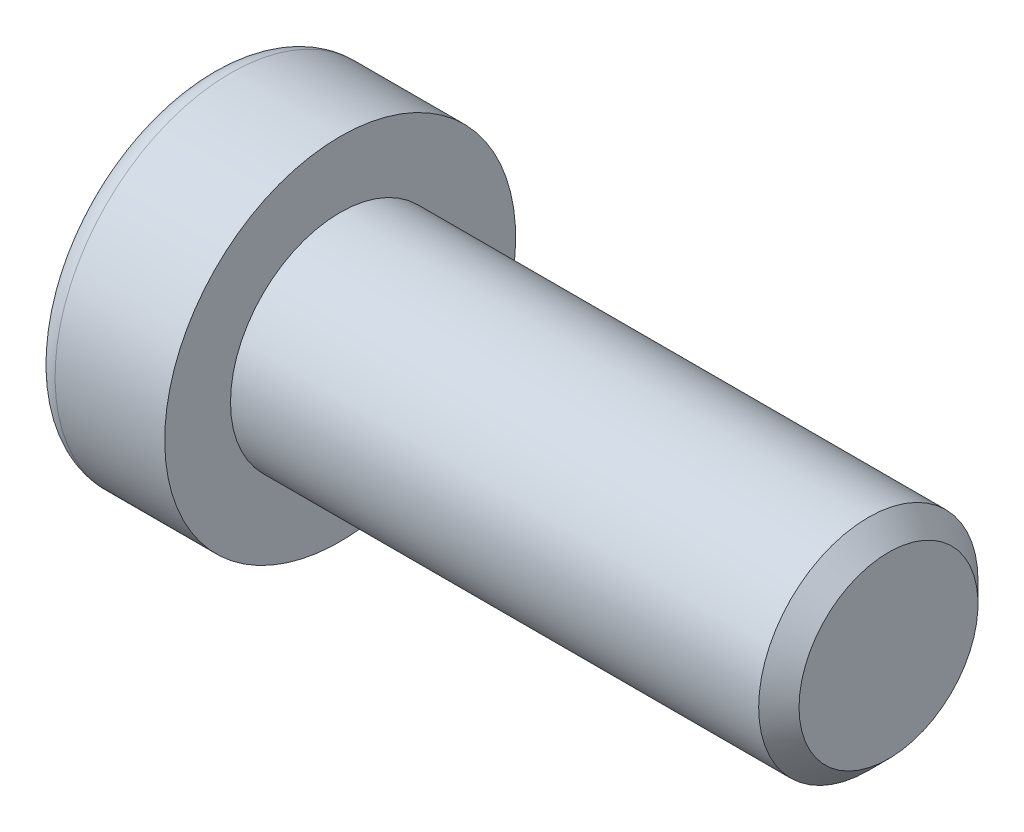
ISO-10303-21;
HEADER;
FILE_DESCRIPTION(('STEP AP214'),'2;1');
FILE_NAME('part.step','',(''),(''),'','','');
FILE_SCHEMA(('AUTOMOTIVE_DESIGN { 1 0 10303 214 1 1 1 1 }'));
ENDSEC;
DATA;
#1=APPLICATION_CONTEXT('core data for automotive mechanical design processes');
#2=APPLICATION_PROTOCOL_DEFINITION('international standard','automotive_design',2000,#1);
#3=PRODUCT_CONTEXT('',#1,'mechanical');
#4=PRODUCT('Part','Part','',(#3));
#5=PRODUCT_RELATED_PRODUCT_CATEGORY('part','',(#4));
#6=PRODUCT_DEFINITION_FORMATION('','',#4);
#7=PRODUCT_DEFINITION_CONTEXT('part definition',#1,'design');
#8=PRODUCT_DEFINITION('design','',#6,#7);
#9=PRODUCT_DEFINITION_SHAPE('','',#8);
#10=(LENGTH_UNIT() NAMED_UNIT(*) SI_UNIT(.MILLI.,.METRE.));
#11=(NAMED_UNIT(*) PLANE_ANGLE_UNIT() SI_UNIT($,.RADIAN.));
#12=(NAMED_UNIT(*) SI_UNIT($,.STERADIAN.) SOLID_ANGLE_UNIT());
#13=UNCERTAINTY_MEASURE_WITH_UNIT(LENGTH_MEASURE(1.E-05),#10,'distance_accuracy_value','');
#14=(GEOMETRIC_REPRESENTATION_CONTEXT(3) GLOBAL_UNCERTAINTY_ASSIGNED_CONTEXT((#13)) GLOBAL_UNIT_ASSIGNED_CONTEXT((#10,
#11,#12)) REPRESENTATION_CONTEXT('',''));
#15=CARTESIAN_POINT('',(0.,0.,0.));
#16=DIRECTION('',(0.,0.,1.));
#17=DIRECTION('',(1.,0.,0.));
#18=AXIS2_PLACEMENT_3D('',#15,#16,#17);
#19=CARTESIAN_POINT('',(-1.51400000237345,0.,0.));
#20=DIRECTION('',(-1.,0.,0.));
#21=DIRECTION('',(0.,0.,1.));
#22=AXIS2_PLACEMENT_3D('',#19,#20,#21);
#23=CONICAL_SURFACE('',#22,4.06570059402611,1.04719754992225);
#24=CARTESIAN_POINT('',(0.833333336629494,-1.70530256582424E-10,0.));
#25=VERTEX_POINT('',#24);
#26=VERTEX_LOOP('',#25);
#27=FACE_BOUND('',#26,.T.);
#28=CARTESIAN_POINT('',(-1.50000000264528,3.50000000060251,2.02072594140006));
#29=CARTESIAN_POINT('',(-1.44871720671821,3.5000000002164,1.84312860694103));
#30=CARTESIAN_POINT('',(-1.40207818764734,3.500000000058,1.66399825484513));
#31=CARTESIAN_POINT('',(-1.3206711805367,3.49999999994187,1.30263602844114));
#32=CARTESIAN_POINT('',(-1.28593198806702,3.49999999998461,1.12039773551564));
#33=CARTESIAN_POINT('',(-1.23185793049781,3.50000000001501,0.758179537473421));
#34=CARTESIAN_POINT('',(-1.21216313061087,3.500000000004,0.578255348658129));
#35=CARTESIAN_POINT('',(-1.18865604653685,3.49999999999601,0.217560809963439));
#36=CARTESIAN_POINT('',(-1.18482429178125,3.499999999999,0.0367917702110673));
#37=CARTESIAN_POINT('',(-1.19281601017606,3.50000000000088,-0.300955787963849));
#38=CARTESIAN_POINT('',(-1.20267725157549,3.50000000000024,-0.457984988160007));
#39=CARTESIAN_POINT('',(-1.23392527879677,3.49999999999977,-0.771020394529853));
#40=CARTESIAN_POINT('',(-1.25532272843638,3.49999999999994,-0.927025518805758));
#41=CARTESIAN_POINT('',(-1.30881221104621,3.50000000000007,-1.24070580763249));
#42=CARTESIAN_POINT('',(-1.34113087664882,3.50000000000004,-1.39834129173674));
#43=CARTESIAN_POINT('',(-1.41448058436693,3.49999999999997,-1.71126180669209));
#44=CARTESIAN_POINT('',(-1.45549440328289,3.49999999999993,-1.86655084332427));
#45=CARTESIAN_POINT('',(-1.50000000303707,3.5,-2.02072594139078));
#46=B_SPLINE_CURVE_WITH_KNOTS('',3,(#28,#29,#30,#31,#32,#33,#34,#35,#36,#37,#38,#39,#40,#41,#42,
#43,#44,#45),.UNSPECIFIED.,.F.,.F.,(4,2,2,2,2,2,2,2,4),(0.,0.554778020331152,1.11088918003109,
1.65323831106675,2.19492155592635,2.66648861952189,3.13849233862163,3.62096283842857,
4.10248645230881),.UNSPECIFIED.);
#47=CARTESIAN_POINT('',(-1.5000000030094,3.49999999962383,2.0207259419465));
#48=VERTEX_POINT('',#47);
#49=CARTESIAN_POINT('',(-1.50000000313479,3.5,-2.02072594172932));
#50=VERTEX_POINT('',#49);
#51=EDGE_CURVE('E20',#48,#50,#46,.T.);
#52=ORIENTED_EDGE('',*,*,#51,.T.);
#53=CARTESIAN_POINT('',(-1.50000000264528,3.49999999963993,-2.0207259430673));
#54=CARTESIAN_POINT('',(-1.44871720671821,3.34619619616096,-2.10952460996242));
#55=CARTESIAN_POINT('',(-1.40207818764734,3.19106476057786,-2.1990897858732));
#56=CARTESIAN_POINT('',(-1.3206711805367,2.87811589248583,-2.37977089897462));
#57=CARTESIAN_POINT('',(-1.28593198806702,2.72029290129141,-2.47089004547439));
#58=CARTESIAN_POINT('',(-1.2318579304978,2.40660274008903,-2.65199914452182));
#59=CARTESIAN_POINT('',(-1.21216313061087,2.25078382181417,-2.74196123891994));
#60=CARTESIAN_POINT('',(-1.18865604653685,1.93841318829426,-2.92230850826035));
#61=CARTESIAN_POINT('',(-1.18482429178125,1.78186260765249,-3.01269302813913));
#62=CARTESIAN_POINT('',(-1.19281601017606,1.48936464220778,-3.18156680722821));
#63=CARTESIAN_POINT('',(-1.20267725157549,1.35337336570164,-3.26008140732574));
#64=CARTESIAN_POINT('',(-1.23392527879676,1.08227675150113,-3.41659911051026));
#65=CARTESIAN_POINT('',(-1.25532272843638,0.947172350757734,-3.49460167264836));
#66=CARTESIAN_POINT('',(-1.30881221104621,0.675517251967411,-3.65144181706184));
#67=CARTESIAN_POINT('',(-1.34113087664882,0.539000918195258,-3.73025955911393));
#68=CARTESIAN_POINT('',(-1.41448058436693,0.26800380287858,-3.88671981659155));
#69=CARTESIAN_POINT('',(-1.45549440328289,0.133519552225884,-3.96436433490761));
#70=CARTESIAN_POINT('',(-1.50000000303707,6.69361529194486E-10,-4.04145188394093));
#71=B_SPLINE_CURVE_WITH_KNOTS('',3,(#53,#54,#55,#56,#57,#58,#59,#60,#61,#62,#63,#64,#65,#66,#67,
#68,#69,#70),.UNSPECIFIED.,.F.,.F.,(4,2,2,2,2,2,2,2,4),(0.,0.554778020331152,1.11088918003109,
1.65323831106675,2.19492155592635,2.66648861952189,3.13849233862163,3.62096283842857,
4.10248645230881),.UNSPECIFIED.);
#72=CARTESIAN_POINT('',(-1.5000000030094,0.,-4.04145188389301));
#73=VERTEX_POINT('',#72);
#74=EDGE_CURVE('E91',#50,#73,#71,.T.);
#75=ORIENTED_EDGE('',*,*,#74,.T.);
#76=CARTESIAN_POINT('',(-1.50000000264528,-9.62577057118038E-10,-4.04145188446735));
#77=CARTESIAN_POINT('',(-1.44871720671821,-0.153803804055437,-3.95265321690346));
#78=CARTESIAN_POINT('',(-1.40207818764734,-0.308935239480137,-3.86308804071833));
#79=CARTESIAN_POINT('',(-1.3206711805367,-0.621884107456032,-3.68240692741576));
#80=CARTESIAN_POINT('',(-1.28593198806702,-0.779707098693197,-3.59128778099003));
#81=CARTESIAN_POINT('',(-1.2318579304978,-1.09339725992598,-3.41017868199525));
#82=CARTESIAN_POINT('',(-1.21216313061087,-1.24921617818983,-3.32021658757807));
#83=CARTESIAN_POINT('',(-1.18865604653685,-1.56158681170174,-3.1398693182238));
#84=CARTESIAN_POINT('',(-1.18482429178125,-1.71813739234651,-3.0494847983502));
#85=CARTESIAN_POINT('',(-1.19281601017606,-2.01063535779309,-2.88061101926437));
#86=CARTESIAN_POINT('',(-1.20267725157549,-2.1466266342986,-2.80209641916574));
#87=CARTESIAN_POINT('',(-1.23392527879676,-2.41772324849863,-2.64557871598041));
#88=CARTESIAN_POINT('',(-1.25532272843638,-2.5528276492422,-2.5675761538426));
#89=CARTESIAN_POINT('',(-1.30881221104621,-2.82448274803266,-2.41073600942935));
#90=CARTESIAN_POINT('',(-1.34113087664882,-2.96099908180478,-2.3319182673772));
#91=CARTESIAN_POINT('',(-1.41448058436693,-3.23199619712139,-2.17545800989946));
#92=CARTESIAN_POINT('',(-1.45549440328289,-3.36648044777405,-2.09781349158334));
#93=CARTESIAN_POINT('',(-1.50000000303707,-3.49999999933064,-2.02072594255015));
#94=B_SPLINE_CURVE_WITH_KNOTS('',3,(#76,#77,#78,#79,#80,#81,#82,#83,#84,#85,#86,#87,#88,#89,#90,
#91,#92,#93),.UNSPECIFIED.,.F.,.F.,(4,2,2,2,2,2,2,2,4),(0.,0.554778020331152,1.11088918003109,
1.65323831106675,2.19492155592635,2.66648861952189,3.13849233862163,3.62096283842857,
4.10248645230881),.UNSPECIFIED.);
#95=CARTESIAN_POINT('',(-1.5000000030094,-3.49999999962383,-2.0207259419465));
#96=VERTEX_POINT('',#95);
#97=EDGE_CURVE('E122',#73,#96,#94,.T.);
#98=ORIENTED_EDGE('',*,*,#97,.T.);
#99=CARTESIAN_POINT('',(-1.50000000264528,-3.50000000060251,-2.02072594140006));
#100=CARTESIAN_POINT('',(-1.44871720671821,-3.50000000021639,-1.84312860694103));
#101=CARTESIAN_POINT('',(-1.40207818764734,-3.500000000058,-1.66399825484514));
#102=CARTESIAN_POINT('',(-1.3206711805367,-3.49999999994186,-1.30263602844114));
#103=CARTESIAN_POINT('',(-1.28593198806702,-3.49999999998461,-1.12039773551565));
#104=CARTESIAN_POINT('',(-1.2318579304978,-3.50000000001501,-0.758179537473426));
#105=CARTESIAN_POINT('',(-1.21216313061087,-3.500000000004,-0.578255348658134));
#106=CARTESIAN_POINT('',(-1.18865604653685,-3.499999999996,-0.217560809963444));
#107=CARTESIAN_POINT('',(-1.18482429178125,-3.499999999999,-0.0367917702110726));
#108=CARTESIAN_POINT('',(-1.19281601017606,-3.50000000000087,0.300955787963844));
#109=CARTESIAN_POINT('',(-1.20267725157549,-3.50000000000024,0.457984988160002));
#110=CARTESIAN_POINT('',(-1.23392527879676,-3.49999999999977,0.771020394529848));
#111=CARTESIAN_POINT('',(-1.25532272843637,-3.49999999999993,0.927025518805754));
#112=CARTESIAN_POINT('',(-1.30881221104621,-3.50000000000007,1.24070580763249));
#113=CARTESIAN_POINT('',(-1.34113087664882,-3.50000000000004,1.39834129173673));
#114=CARTESIAN_POINT('',(-1.41448058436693,-3.49999999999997,1.71126180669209));
#115=CARTESIAN_POINT('',(-1.45549440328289,-3.49999999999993,1.86655084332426));
#116=CARTESIAN_POINT('',(-1.50000000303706,-3.5,2.02072594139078));
#117=B_SPLINE_CURVE_WITH_KNOTS('',3,(#99,#100,#101,#102,#103,#104,#105,#106,#107,#108,#109,#110,
#111,#112,#113,#114,#115,#116),.UNSPECIFIED.,.F.,.F.,(4,2,2,2,2,2,2,2,4),(0.,0.554778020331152,
1.11088918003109,1.65323831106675,2.19492155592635,2.66648861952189,3.13849233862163,
3.62096283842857,4.10248645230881),.UNSPECIFIED.);
#118=CARTESIAN_POINT('',(-1.5000000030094,-3.49999999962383,2.0207259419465));
#119=VERTEX_POINT('',#118);
#120=EDGE_CURVE('E146',#96,#119,#117,.T.);
#121=ORIENTED_EDGE('',*,*,#120,.T.);
#122=CARTESIAN_POINT('',(-1.50000000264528,-3.49999999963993,2.02072594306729));
#123=CARTESIAN_POINT('',(-1.44871720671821,-3.34619619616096,2.10952460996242));
#124=CARTESIAN_POINT('',(-1.40207818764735,-3.19106476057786,2.19908978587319));
#125=CARTESIAN_POINT('',(-1.3206711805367,-2.87811589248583,2.37977089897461));
#126=CARTESIAN_POINT('',(-1.28593198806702,-2.72029290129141,2.47089004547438));
#127=CARTESIAN_POINT('',(-1.2318579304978,-2.40660274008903,2.65199914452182));
#128=CARTESIAN_POINT('',(-1.21216313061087,-2.25078382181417,2.74196123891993));
#129=CARTESIAN_POINT('',(-1.18865604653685,-1.93841318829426,2.92230850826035));
#130=CARTESIAN_POINT('',(-1.18482429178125,-1.78186260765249,3.01269302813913));
#131=CARTESIAN_POINT('',(-1.19281601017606,-1.48936464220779,3.18156680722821));
#132=CARTESIAN_POINT('',(-1.20267725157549,-1.35337336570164,3.26008140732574));
#133=CARTESIAN_POINT('',(-1.23392527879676,-1.08227675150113,3.41659911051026));
#134=CARTESIAN_POINT('',(-1.25532272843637,-0.947172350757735,3.49460167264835));
#135=CARTESIAN_POINT('',(-1.30881221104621,-0.675517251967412,3.65144181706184));
#136=CARTESIAN_POINT('',(-1.34113087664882,-0.539000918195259,3.73025955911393));
#137=CARTESIAN_POINT('',(-1.41448058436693,-0.268003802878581,3.88671981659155));
#138=CARTESIAN_POINT('',(-1.45549440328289,-0.133519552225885,3.96436433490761));
#139=CARTESIAN_POINT('',(-1.50000000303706,-6.693623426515E-10,4.04145188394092));
#140=B_SPLINE_CURVE_WITH_KNOTS('',3,(#122,#123,#124,#125,#126,#127,#128,#129,#130,#131,#132,
#133,#134,#135,#136,#137,#138,#139),.UNSPECIFIED.,.F.,.F.,(4,2,2,2,2,2,2,2,4),(0.,
0.554778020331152,1.11088918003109,1.65323831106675,2.19492155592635,2.66648861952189,
3.13849233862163,3.62096283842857,4.10248645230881),.UNSPECIFIED.);
#141=CARTESIAN_POINT('',(-1.5000000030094,0.,4.04145188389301));
#142=VERTEX_POINT('',#141);
#143=EDGE_CURVE('E155',#119,#142,#140,.T.);
#144=ORIENTED_EDGE('',*,*,#143,.T.);
#145=CARTESIAN_POINT('',(-1.50000000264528,9.6257699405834E-10,4.04145188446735));
#146=CARTESIAN_POINT('',(-1.44871720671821,0.153803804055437,3.95265321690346));
#147=CARTESIAN_POINT('',(-1.40207818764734,0.308935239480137,3.86308804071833));
#148=CARTESIAN_POINT('',(-1.3206711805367,0.621884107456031,3.68240692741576));
#149=CARTESIAN_POINT('',(-1.28593198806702,0.779707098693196,3.59128778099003));
#150=CARTESIAN_POINT('',(-1.2318579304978,1.09339725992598,3.41017868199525));
#151=CARTESIAN_POINT('',(-1.21216313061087,1.24921617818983,3.32021658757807));
#152=CARTESIAN_POINT('',(-1.18865604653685,1.56158681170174,3.1398693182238));
#153=CARTESIAN_POINT('',(-1.18482429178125,1.71813739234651,3.0494847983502));
#154=CARTESIAN_POINT('',(-1.19281601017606,2.01063535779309,2.88061101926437));
#155=CARTESIAN_POINT('',(-1.20267725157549,2.14662663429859,2.80209641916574));
#156=CARTESIAN_POINT('',(-1.23392527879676,2.41772324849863,2.6455787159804));
#157=CARTESIAN_POINT('',(-1.25532272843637,2.5528276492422,2.5675761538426));
#158=CARTESIAN_POINT('',(-1.30881221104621,2.82448274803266,2.41073600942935));
#159=CARTESIAN_POINT('',(-1.34113087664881,2.96099908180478,2.33191826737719));
#160=CARTESIAN_POINT('',(-1.41448058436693,3.23199619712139,2.17545800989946));
#161=CARTESIAN_POINT('',(-1.45549440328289,3.36648044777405,2.09781349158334));
#162=CARTESIAN_POINT('',(-1.50000000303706,3.49999999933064,2.02072594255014));
#163=B_SPLINE_CURVE_WITH_KNOTS('',3,(#145,#146,#147,#148,#149,#150,#151,#152,#153,#154,#155,
#156,#157,#158,#159,#160,#161,#162),.UNSPECIFIED.,.F.,.F.,(4,2,2,2,2,2,2,2,4),(0.,
0.554778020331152,1.11088918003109,1.65323831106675,2.19492155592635,2.66648861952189,
3.13849233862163,3.62096283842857,4.10248645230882),.UNSPECIFIED.);
#164=EDGE_CURVE('E93',#142,#48,#163,.T.);
#165=ORIENTED_EDGE('',*,*,#164,.T.);
#166=EDGE_LOOP('',(#52,#75,#98,#121,#144,#165));
#167=FACE_BOUND('',#166,.T.);
#168=ADVANCED_FACE('F16',(#27,#167),#23,.F.);
#169=CARTESIAN_POINT('',(-6.,3.5,2.02072594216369));
#170=DIRECTION('',(0.,1.,0.));
#171=DIRECTION('',(0.,0.,1.));
#172=AXIS2_PLACEMENT_3D('',#169,#170,#171);
#173=PLANE('',#172);
#174=DIRECTION('',(1.,0.,0.));
#175=VECTOR('',#174,1.);
#176=CARTESIAN_POINT('',(-6.,3.5,2.02072594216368));
#177=LINE('',#176,#175);
#178=CARTESIAN_POINT('',(-6.,3.5,2.02072594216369));
#179=VERTEX_POINT('',#178);
#180=EDGE_CURVE('E97',#48,#179,#177,.F.);
#181=ORIENTED_EDGE('',*,*,#180,.T.);
#182=DIRECTION('',(0.,0.,1.));
#183=VECTOR('',#182,1.);
#184=CARTESIAN_POINT('',(-6.,3.5,0.));
#185=LINE('',#184,#183);
#186=CARTESIAN_POINT('',(-6.,3.5,-2.02072594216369));
#187=VERTEX_POINT('',#186);
#188=EDGE_CURVE('E102',#187,#179,#185,.T.);
#189=ORIENTED_EDGE('',*,*,#188,.F.);
#190=DIRECTION('',(1.,0.,0.));
#191=VECTOR('',#190,1.);
#192=CARTESIAN_POINT('',(-6.,3.5,-2.02072594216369));
#193=LINE('',#192,#191);
#194=EDGE_CURVE('E100',#187,#50,#193,.T.);
#195=ORIENTED_EDGE('',*,*,#194,.T.);
#196=ORIENTED_EDGE('',*,*,#51,.F.);
#197=EDGE_LOOP('',(#181,#189,#195,#196));
#198=FACE_BOUND('',#197,.T.);
#199=ADVANCED_FACE('F87',(#198),#173,.F.);
#200=CARTESIAN_POINT('',(-6.,0.,4.04145188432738));
#201=DIRECTION('',(0.,0.500000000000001,0.866025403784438));
#202=DIRECTION('',(0.,-0.866025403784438,0.500000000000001));
#203=AXIS2_PLACEMENT_3D('',#200,#201,#202);
#204=PLANE('',#203);
#205=DIRECTION('',(1.,0.,0.));
#206=VECTOR('',#205,1.);
#207=CARTESIAN_POINT('',(-6.,0.,4.04145188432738));
#208=LINE('',#207,#206);
#209=CARTESIAN_POINT('',(-6.,0.,4.04145188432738));
#210=VERTEX_POINT('',#209);
#211=EDGE_CURVE('E160',#142,#210,#208,.F.);
#212=ORIENTED_EDGE('',*,*,#211,.T.);
#213=DIRECTION('',(0.,-0.866025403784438,0.500000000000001));
#214=VECTOR('',#213,1.);
#215=CARTESIAN_POINT('',(-6.,3.5,2.02072594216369));
#216=LINE('',#215,#214);
#217=EDGE_CURVE('E112',#179,#210,#216,.T.);
#218=ORIENTED_EDGE('',*,*,#217,.F.);
#219=ORIENTED_EDGE('',*,*,#180,.F.);
#220=ORIENTED_EDGE('',*,*,#164,.F.);
#221=EDGE_LOOP('',(#212,#218,#219,#220));
#222=FACE_BOUND('',#221,.T.);
#223=ADVANCED_FACE('F165',(#222),#204,.F.);
#224=CARTESIAN_POINT('',(-6.,-3.5,2.02072594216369));
#225=DIRECTION('',(0.,-0.5,0.866025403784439));
#226=DIRECTION('',(0.,-0.866025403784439,-0.5));
#227=AXIS2_PLACEMENT_3D('',#224,#225,#226);
#228=PLANE('',#227);
#229=DIRECTION('',(1.,0.,0.));
#230=VECTOR('',#229,1.);
#231=CARTESIAN_POINT('',(-6.,-3.5,2.02072594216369));
#232=LINE('',#231,#230);
#233=CARTESIAN_POINT('',(-6.,-3.5,2.02072594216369));
#234=VERTEX_POINT('',#233);
#235=EDGE_CURVE('E154',#119,#234,#232,.F.);
#236=ORIENTED_EDGE('',*,*,#235,.T.);
#237=DIRECTION('',(0.,-0.866025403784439,-0.5));
#238=VECTOR('',#237,1.);
#239=CARTESIAN_POINT('',(-6.,0.,4.04145188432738));
#240=LINE('',#239,#238);
#241=EDGE_CURVE('E251',#210,#234,#240,.T.);
#242=ORIENTED_EDGE('',*,*,#241,.F.);
#243=ORIENTED_EDGE('',*,*,#211,.F.);
#244=ORIENTED_EDGE('',*,*,#143,.F.);
#245=EDGE_LOOP('',(#236,#242,#243,#244));
#246=FACE_BOUND('',#245,.T.);
#247=ADVANCED_FACE('F142',(#246),#228,.F.);
#248=CARTESIAN_POINT('',(-6.,-3.5,-2.02072594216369));
#249=DIRECTION('',(0.,-1.,0.));
#250=DIRECTION('',(0.,0.,-1.));
#251=AXIS2_PLACEMENT_3D('',#248,#249,#250);
#252=PLANE('',#251);
#253=DIRECTION('',(1.,0.,0.));
#254=VECTOR('',#253,1.);
#255=CARTESIAN_POINT('',(-6.,-3.5,-2.02072594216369));
#256=LINE('',#255,#254);
#257=CARTESIAN_POINT('',(-6.,-3.5,-2.02072594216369));
#258=VERTEX_POINT('',#257);
#259=EDGE_CURVE('E153',#96,#258,#256,.F.);
#260=ORIENTED_EDGE('',*,*,#259,.T.);
#261=DIRECTION('',(0.,0.,1.));
#262=VECTOR('',#261,1.);
#263=CARTESIAN_POINT('',(-6.,-3.5,0.));
#264=LINE('',#263,#262);
#265=EDGE_CURVE('E247',#234,#258,#264,.F.);
#266=ORIENTED_EDGE('',*,*,#265,.F.);
#267=ORIENTED_EDGE('',*,*,#235,.F.);
#268=ORIENTED_EDGE('',*,*,#120,.F.);
#269=EDGE_LOOP('',(#260,#266,#267,#268));
#270=FACE_BOUND('',#269,.T.);
#271=ADVANCED_FACE('F138',(#270),#252,.F.);
#272=CARTESIAN_POINT('',(-6.,0.,-4.04145188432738));
#273=DIRECTION('',(0.,-0.5,-0.866025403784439));
#274=DIRECTION('',(0.,0.866025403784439,-0.5));
#275=AXIS2_PLACEMENT_3D('',#272,#273,#274);
#276=PLANE('',#275);
#277=DIRECTION('',(1.,0.,0.));
#278=VECTOR('',#277,1.);
#279=CARTESIAN_POINT('',(-6.,0.,-4.04145188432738));
#280=LINE('',#279,#278);
#281=CARTESIAN_POINT('',(-6.,0.,-4.04145188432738));
#282=VERTEX_POINT('',#281);
#283=EDGE_CURVE('E41',#73,#282,#280,.F.);
#284=ORIENTED_EDGE('',*,*,#283,.T.);
#285=DIRECTION('',(0.,0.866025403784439,-0.5));
#286=VECTOR('',#285,1.);
#287=CARTESIAN_POINT('',(-6.,-3.5,-2.02072594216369));
#288=LINE('',#287,#286);
#289=EDGE_CURVE('E243',#258,#282,#288,.T.);
#290=ORIENTED_EDGE('',*,*,#289,.F.);
#291=ORIENTED_EDGE('',*,*,#259,.F.);
#292=ORIENTED_EDGE('',*,*,#97,.F.);
#293=EDGE_LOOP('',(#284,#290,#291,#292));
#294=FACE_BOUND('',#293,.T.);
#295=ADVANCED_FACE('F132',(#294),#276,.F.);
#296=CARTESIAN_POINT('',(-6.,3.5,-2.02072594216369));
#297=DIRECTION('',(0.,0.5,-0.866025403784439));
#298=DIRECTION('',(0.,0.866025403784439,0.5));
#299=AXIS2_PLACEMENT_3D('',#296,#297,#298);
#300=PLANE('',#299);
#301=ORIENTED_EDGE('',*,*,#194,.F.);
#302=DIRECTION('',(0.,0.866025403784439,0.5));
#303=VECTOR('',#302,1.);
#304=CARTESIAN_POINT('',(-6.,0.,-4.04145188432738));
#305=LINE('',#304,#303);
#306=EDGE_CURVE('E240',#282,#187,#305,.T.);
#307=ORIENTED_EDGE('',*,*,#306,.F.);
#308=ORIENTED_EDGE('',*,*,#283,.F.);
#309=ORIENTED_EDGE('',*,*,#74,.F.);
#310=EDGE_LOOP('',(#301,#307,#308,#309));
#311=FACE_BOUND('',#310,.T.);
#312=ADVANCED_FACE('F107',(#311),#300,.F.);
#313=CARTESIAN_POINT('',(-6.,6.02072594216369,0.));
#314=DIRECTION('',(-1.,0.,0.));
#315=DIRECTION('',(0.,0.,1.));
#316=AXIS2_PLACEMENT_3D('',#313,#314,#315);
#317=PLANE('',#316);
#318=ORIENTED_EDGE('',*,*,#289,.T.);
#319=ORIENTED_EDGE('',*,*,#306,.T.);
#320=ORIENTED_EDGE('',*,*,#188,.T.);
#321=ORIENTED_EDGE('',*,*,#217,.T.);
#322=ORIENTED_EDGE('',*,*,#241,.T.);
#323=ORIENTED_EDGE('',*,*,#265,.T.);
#324=EDGE_LOOP('',(#318,#319,#320,#321,#322,#323));
#325=FACE_BOUND('',#324,.T.);
#326=CARTESIAN_POINT('',(-6.,0.,0.));
#327=DIRECTION('',(1.,0.,0.));
#328=DIRECTION('',(0.,1.,0.));
#329=AXIS2_PLACEMENT_3D('',#326,#327,#328);
#330=CIRCLE('',#329,7.);
#331=CARTESIAN_POINT('',(-6.,7.,0.));
#332=VERTEX_POINT('',#331);
#333=EDGE_CURVE('E212',#332,#332,#330,.T.);
#334=ORIENTED_EDGE('',*,*,#333,.F.);
#335=EDGE_LOOP('',(#334));
#336=FACE_BOUND('',#335,.T.);
#337=ADVANCED_FACE('F131',(#325,#336),#317,.T.);
#338=CARTESIAN_POINT('',(-5.,0.,0.));
#339=DIRECTION('',(1.,0.,0.));
#340=DIRECTION('',(0.,0.,-1.));
#341=AXIS2_PLACEMENT_3D('',#338,#339,#340);
#342=TOROIDAL_SURFACE('',#341,7.,1.);
#343=CARTESIAN_POINT('',(-5.,0.,0.));
#344=DIRECTION('',(1.,0.,0.));
#345=DIRECTION('',(0.,1.,0.));
#346=AXIS2_PLACEMENT_3D('',#343,#344,#345);
#347=CIRCLE('',#346,8.);
#348=CARTESIAN_POINT('',(-5.,8.,0.));
#349=VERTEX_POINT('',#348);
#350=EDGE_CURVE('E265',#349,#349,#347,.T.);
#351=ORIENTED_EDGE('',*,*,#350,.F.);
#352=EDGE_LOOP('',(#351));
#353=FACE_BOUND('',#352,.T.);
#354=ORIENTED_EDGE('',*,*,#333,.T.);
#355=EDGE_LOOP('',(#354));
#356=FACE_BOUND('',#355,.T.);
#357=ADVANCED_FACE('F196',(#353,#356),#342,.T.);
#358=CARTESIAN_POINT('',(-3.,0.,0.));
#359=DIRECTION('',(1.,0.,0.));
#360=DIRECTION('',(0.,1.,0.));
#361=AXIS2_PLACEMENT_3D('',#358,#359,#360);
#362=CYLINDRICAL_SURFACE('',#361,8.);
#363=ORIENTED_EDGE('',*,*,#350,.T.);
#364=EDGE_LOOP('',(#363));
#365=FACE_BOUND('',#364,.T.);
#366=CARTESIAN_POINT('',(0.,0.,0.));
#367=DIRECTION('',(1.,0.,0.));
#368=DIRECTION('',(0.,1.,0.));
#369=AXIS2_PLACEMENT_3D('',#366,#367,#368);
#370=CIRCLE('',#369,8.);
#371=CARTESIAN_POINT('',(0.,8.,0.));
#372=VERTEX_POINT('',#371);
#373=EDGE_CURVE('E120',#372,#372,#370,.T.);
#374=ORIENTED_EDGE('',*,*,#373,.F.);
#375=EDGE_LOOP('',(#374));
#376=FACE_BOUND('',#375,.T.);
#377=ADVANCED_FACE('F193',(#365,#376),#362,.T.);
#378=CARTESIAN_POINT('',(25.,2.5,0.));
#379=DIRECTION('',(1.,0.,0.));
#380=DIRECTION('',(0.,0.,-1.));
#381=AXIS2_PLACEMENT_3D('',#378,#379,#380);
#382=PLANE('',#381);
#383=CARTESIAN_POINT('',(25.000000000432,0.,0.));
#384=DIRECTION('',(-1.,0.,0.));
#385=DIRECTION('',(0.,0.,1.));
#386=AXIS2_PLACEMENT_3D('',#383,#384,#385);
#387=CIRCLE('',#386,4.07982500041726);
#388=CARTESIAN_POINT('',(25.000000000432,0.,4.07982500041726));
#389=VERTEX_POINT('',#388);
#390=EDGE_CURVE('E260',#389,#389,#387,.T.);
#391=ORIENTED_EDGE('',*,*,#390,.F.);
#392=EDGE_LOOP('',(#391));
#393=FACE_BOUND('',#392,.T.);
#394=ADVANCED_FACE('F189',(#393),#382,.T.);
#395=CARTESIAN_POINT('',(0.,6.5,0.));
#396=DIRECTION('',(1.,0.,0.));
#397=DIRECTION('',(0.,0.,-1.));
#398=AXIS2_PLACEMENT_3D('',#395,#396,#397);
#399=PLANE('',#398);
#400=CARTESIAN_POINT('',(0.,0.,0.));
#401=DIRECTION('',(1.,0.,0.));
#402=DIRECTION('',(0.,1.,0.));
#403=AXIS2_PLACEMENT_3D('',#400,#401,#402);
#404=CIRCLE('',#403,5.);
#405=CARTESIAN_POINT('',(0.,5.,0.));
#406=VERTEX_POINT('',#405);
#407=EDGE_CURVE('E29',#406,#406,#404,.T.);
#408=ORIENTED_EDGE('',*,*,#407,.F.);
#409=EDGE_LOOP('',(#408));
#410=FACE_BOUND('',#409,.T.);
#411=ORIENTED_EDGE('',*,*,#373,.T.);
#412=EDGE_LOOP('',(#411));
#413=FACE_BOUND('',#412,.T.);
#414=ADVANCED_FACE('F182',(#410,#413),#399,.T.);
#415=CARTESIAN_POINT('',(24.0798249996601,0.,0.));
#416=DIRECTION('',(-1.,0.,0.));
#417=DIRECTION('',(0.,0.,1.));
#418=AXIS2_PLACEMENT_3D('',#415,#416,#417);
#419=CONICAL_SURFACE('',#418,4.99999999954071,0.785398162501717);
#420=ORIENTED_EDGE('',*,*,#390,.T.);
#421=EDGE_LOOP('',(#420));
#422=FACE_BOUND('',#421,.T.);
#423=CARTESIAN_POINT('',(24.079825,0.,0.));
#424=DIRECTION('',(1.,0.,0.));
#425=DIRECTION('',(0.,1.,0.));
#426=AXIS2_PLACEMENT_3D('',#423,#424,#425);
#427=CIRCLE('',#426,5.);
#428=CARTESIAN_POINT('',(24.079825,5.,0.));
#429=VERTEX_POINT('',#428);
#430=EDGE_CURVE('E11',#429,#429,#427,.F.);
#431=ORIENTED_EDGE('',*,*,#430,.F.);
#432=EDGE_LOOP('',(#431));
#433=FACE_BOUND('',#432,.T.);
#434=ADVANCED_FACE('F176',(#422,#433),#419,.T.);
#435=CARTESIAN_POINT('',(14.75,0.,0.));
#436=DIRECTION('',(1.,0.,0.));
#437=DIRECTION('',(0.,1.,0.));
#438=AXIS2_PLACEMENT_3D('',#435,#436,#437);
#439=CYLINDRICAL_SURFACE('',#438,5.);
#440=ORIENTED_EDGE('',*,*,#430,.T.);
#441=EDGE_LOOP('',(#440));
#442=FACE_BOUND('',#441,.T.);
#443=ORIENTED_EDGE('',*,*,#407,.T.);
#444=EDGE_LOOP('',(#443));
#445=FACE_BOUND('',#444,.T.);
#446=ADVANCED_FACE('F174',(#442,#445),#439,.T.);
#447=CLOSED_SHELL('',(#168,#199,#223,#247,#271,#295,#312,#337,#357,#377,#394,#414,#434,#446));
#448=MANIFOLD_SOLID_BREP('B1',#447);
#449=ADVANCED_BREP_SHAPE_REPRESENTATION('',(#18,#448),#14);
#450=SHAPE_DEFINITION_REPRESENTATION(#9,#449);
ENDSEC;
END-ISO-10303-21;
